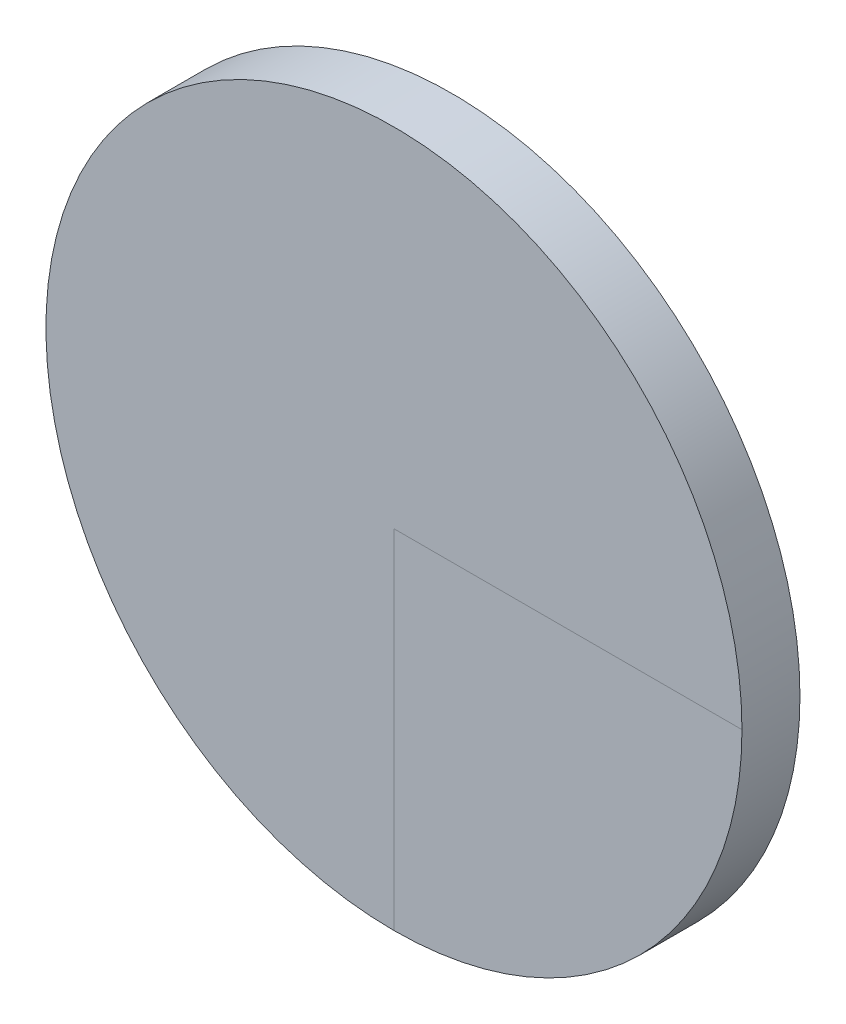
from build123d import *

# Parameters (mm, degrees)
SKETCH1_R      = 60
EXTRUDE1_DEPTH = 10


with BuildPart() as part:
    # Sketch1 → Extrude1 (new body)
    with BuildSketch(Plane.XY):
        Circle(SKETCH1_R)
    extrude(amount=EXTRUDE1_DEPTH)


solid = part.part
